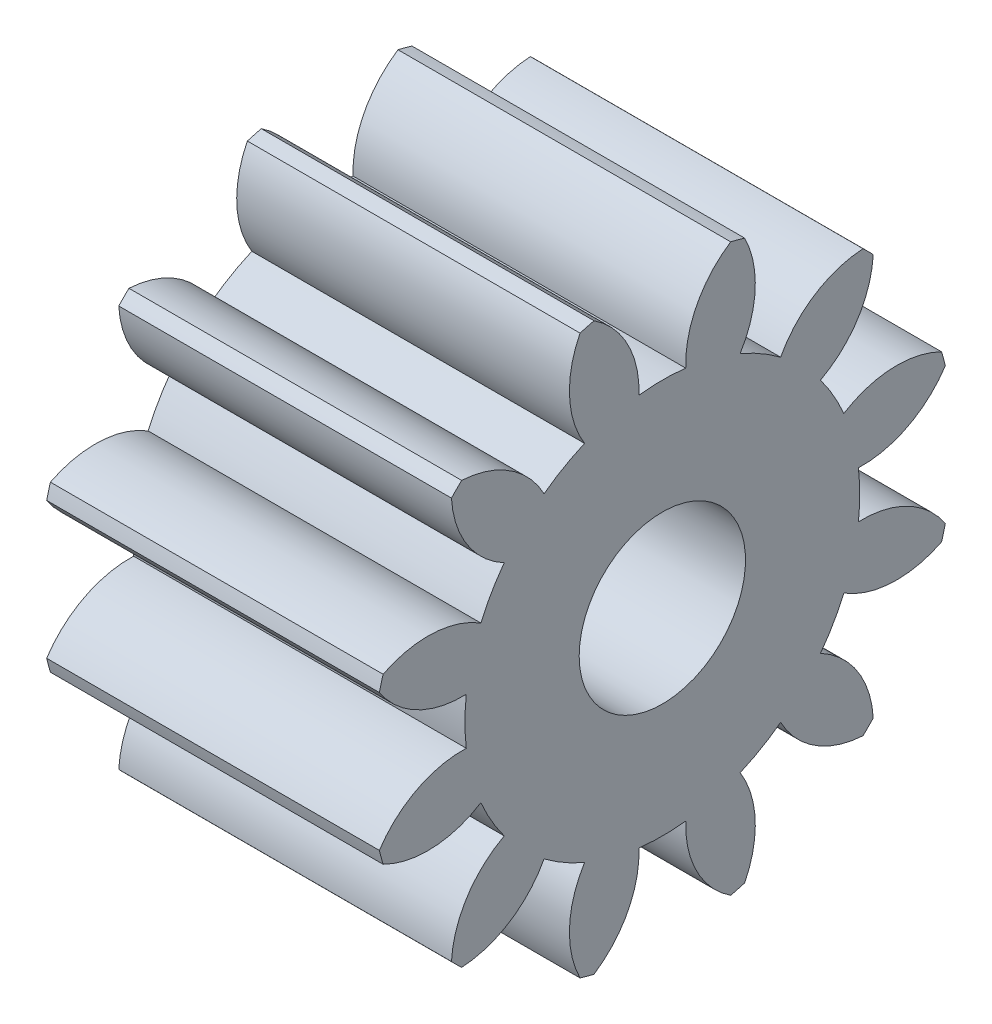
from build123d import *

# Parameters (mm, degrees)
BASPROSKE_W     = 4
BASPROSKE_H     = 3.5
TOOTHCUT_DEPTH  = 7.363961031
TEETHCUTS_COUNT = 12
BORSKE_R        = 1
BORE_DEPTH      = 4.5000508


with BuildPart() as part:
    # BasProSke → Base-Revolve (revolve)
    with BuildSketch(Plane(origin=(0, 0, 0), x_dir=(1, 0, 0), z_dir=(0, 1, 0)), mode=Mode.PRIVATE) as base_revolve_sk:
        with Locations((2, 1.75)):
            Rectangle(BASPROSKE_W, BASPROSKE_H)
    revolve(base_revolve_sk.sketch.rotate(Axis((-10, 0, 0), (1, 0, 0)), 180), axis=Axis((-10, 0, 0), (1, 0, 0)))

    # TooCutSke → ToothCut (cut, through all)
    with BuildSketch(Plane(origin=(0, 0, 0), x_dir=(0, 0, -1), z_dir=(1, 0, 0))):
        with BuildLine():
            ThreePointArc((0.281121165, 2.357296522), (0, 2.374), (-0.281121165, 2.357296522))
            ThreePointArc((-0.281121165, 2.357296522), (-0.422795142, 2.966088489), (-0.851415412, 3.421043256))
            ThreePointArc((-0.851415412, 3.421043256), (0, 3.5254), (0.851415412, 3.421043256))
            ThreePointArc((0.851415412, 3.421043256), (0.422795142, 2.966088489), (0.281121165, 2.357296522))
        make_face()
    toothcut = extrude(amount=TOOTHCUT_DEPTH, mode=Mode.SUBTRACT)

    # TeethCuts: ToothCut ×12 about axis
    teethcuts_axis = Axis((0, 0, 0), (1, 0, 0))
    for i in range(1, TEETHCUTS_COUNT):
        add(toothcut.rotate(teethcuts_axis, i * 360 / TEETHCUTS_COUNT), mode=Mode.SUBTRACT)

    # BorSke → Bore (cut, symmetric)
    with BuildSketch(Plane(origin=(0, 0, 0), x_dir=(0, 0, -1), z_dir=(1, 0, 0))):
        with Locations(Location((0, 0, 0), (0, 0, 180))):
            Circle(BORSKE_R)
    extrude(amount=BORE_DEPTH, both=True, mode=Mode.SUBTRACT)


solid = part.part
